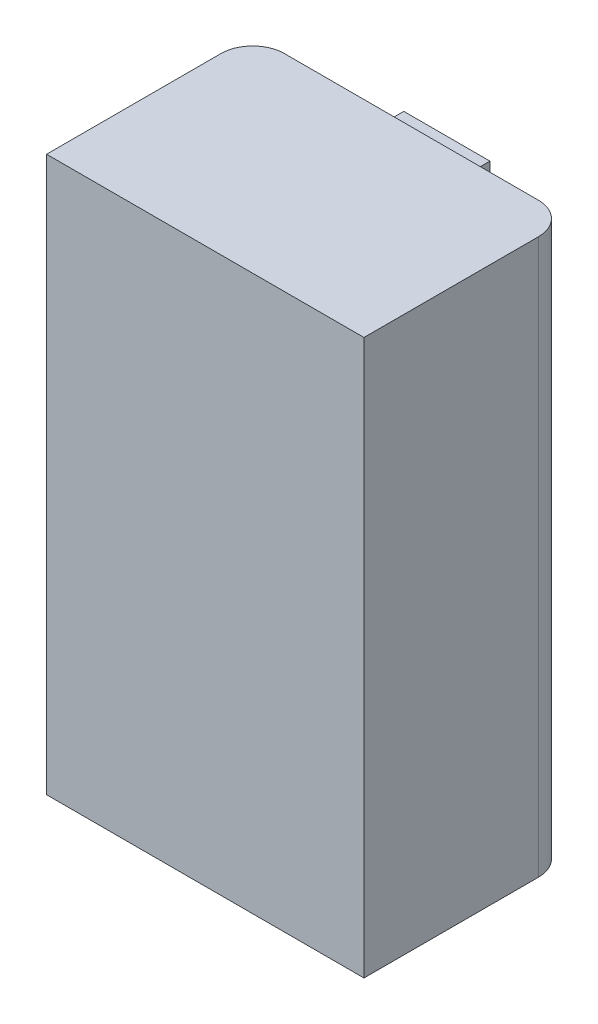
from build123d import *

# Parameters (mm, degrees)
SKETCH2_W           = 20.02592565
SKETCH2_H           = 13.003847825
BOSS_EXTRUDE1_DEPTH = 35
SKETCH4_W           = 14.816702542
SKETCH4_H           = 6.532804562
CUT_EXTRUDE1_DEPTH  = 6
FILLET1_R           = 2
BOSS_EXTRUDE2_DEPTH = 1.5


with BuildPart() as part:
    # Sketch2 → Boss-Extrude1 (new body)
    with BuildSketch(Plane(origin=(0, 0, 0), x_dir=(1, 0, 0), z_dir=(0, 1, 0))):
        with Locations((10.012962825, 6.501923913)):
            Rectangle(SKETCH2_W, SKETCH2_H)
    extrude(amount=BOSS_EXTRUDE1_DEPTH)

    # Sketch4 → Cut-Extrude1 (cut)
    with BuildSketch(Plane(origin=(0, 0, 0), x_dir=(-1, 0, 0), z_dir=(0, -1, 0))):
        with Locations((-10.016920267, 6.566876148)):
            Rectangle(SKETCH4_W, SKETCH4_H)
    extrude(amount=-CUT_EXTRUDE1_DEPTH, mode=Mode.SUBTRACT)

    # Fillet1
    fillet1_edges = [part.edges().sort_by_distance(p)[0] for p in [
        (0, 17.5, -13.003847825),
        (20.02592565, 17.5, -13.003847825),
    ]]
    fillet(fillet1_edges, radius=FILLET1_R)

    # Sketch5 → Boss-Extrude2 (add)
    # profile 1 of 4: a face of its own
    with BuildSketch(Plane(origin=(0, 0, -13.003847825), x_dir=(-1, 0, 0), z_dir=(0, 0, -1))):
        with BuildLine():
            Line((-13.469742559, 34.10669146), (-8.035448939, 34.10669146))
            Line((-8.035448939, 34.10669146), (-8.035448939, 30.88938492))
            add(Edge.make_bspline(
                [(-8.035448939, 30.88938492), (-8.037855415, 30.742353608), (-8.042555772, 30.455170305), (-8.080628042, 30.035594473), (-8.140862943, 29.63808396), (-8.228660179, 29.262985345), (-8.339571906, 28.909300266), (-8.476839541, 28.577912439), (-8.639649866, 28.2691009), (-8.794296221, 28.028995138), (-8.930487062, 27.852214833), (-9.032700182, 27.726830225), (-9.138296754, 27.610322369), (-9.248109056, 27.503497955), (-9.359377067, 27.40424544), (-9.473886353, 27.314545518), (-9.590354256, 27.232987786), (-9.70906201, 27.15900969), (-9.831782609, 27.095028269), (-9.957086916, 27.039677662), (-10.084449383, 26.990949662), (-10.214978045, 26.953233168), (-10.347653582, 26.922374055), (-10.483404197, 26.901888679), (-10.621671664, 26.888651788), (-10.714956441, 26.886741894), (-10.761901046, 26.885780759)],
                knots=[0, 0, 0, 0, 1.969308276, 3.846476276, 5.638853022, 7.350989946, 9.001834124, 10.599151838, 12.148782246, 13.672952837, 14.417780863, 15.137334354, 15.839584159, 16.522732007, 17.188703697, 17.836024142, 18.470017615, 19.092698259, 19.708342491, 20.322187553, 20.927045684, 21.533485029, 22.140791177, 22.750491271, 23.371197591, 24, 24, 24, 24], degree=3))
            add(Edge.make_bspline(
                [(-10.761901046, 26.885780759), (-10.808842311, 26.886764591), (-10.902120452, 26.888719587), (-11.040879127, 26.90166478), (-11.176967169, 26.923516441), (-11.31006788, 26.95543547), (-11.440244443, 26.994876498), (-11.568142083, 27.042444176), (-11.692127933, 27.100909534), (-11.81362104, 27.168070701), (-11.933616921, 27.241347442), (-12.048711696, 27.326853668), (-12.163629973, 27.417813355), (-12.272939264, 27.520738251), (-12.381304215, 27.630896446), (-12.486389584, 27.750203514), (-12.588808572, 27.878333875), (-12.687898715, 28.014870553), (-12.783033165, 28.159171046), (-12.871252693, 28.312157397), (-12.954092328, 28.471971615), (-13.031254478, 28.63939648), (-13.09976973, 28.815252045), (-13.166292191, 28.997256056), (-13.223850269, 29.187683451), (-13.274371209, 29.385907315), (-13.321609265, 29.59041391), (-13.360854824, 29.803174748), (-13.394172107, 30.023168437), (-13.42260064, 30.25076922), (-13.442999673, 30.485926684), (-13.458040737, 30.728714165), (-13.46754809, 30.978873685), (-13.469004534, 31.147986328), (-13.469742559, 31.23368092)],
                knots=[0, 0, 0, 0, 0.791994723, 1.573792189, 2.34921381, 3.115614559, 3.881316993, 4.643153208, 5.415782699, 6.191618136, 6.984908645, 7.785716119, 8.609182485, 9.456318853, 10.316763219, 11.215879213, 12.137419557, 13.083478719, 14.061456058, 15.052215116, 16.061652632, 17.097909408, 18.160852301, 19.245140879, 20.36675602, 21.515514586, 22.696239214, 23.907451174, 25.164795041, 26.450078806, 27.776766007, 29.146652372, 30.55412074, 32, 32, 32, 32], degree=3))
            Line((-13.469742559, 31.23368092), (-13.469742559, 34.10669146))
        make_face()
        with BuildLine():
            Line((-12.50199164, 32.320074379), (-12.50199164, 31.172033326))
            add(Edge.make_bspline(
                [(-12.50199164, 31.172033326), (-12.500715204, 31.088238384), (-12.498211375, 30.923868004), (-12.476679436, 30.68264226), (-12.442525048, 30.451238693), (-12.391981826, 30.230337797), (-12.329594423, 30.019010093), (-12.252766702, 29.817651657), (-12.160333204, 29.627187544), (-12.057005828, 29.446964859), (-11.939484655, 29.282411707), (-11.805538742, 29.139213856), (-11.658748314, 29.017017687), (-11.496959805, 28.91847568), (-11.322647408, 28.84103501), (-11.134368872, 28.786930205), (-10.933039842, 28.751734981), (-10.793849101, 28.748501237), (-10.722353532, 28.746840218)],
                knots=[0, 0, 0, 0, 1.1894114, 2.333124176, 3.435436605, 4.507723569, 5.547416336, 6.561483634, 7.563483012, 8.550063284, 9.507973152, 10.427061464, 11.326354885, 12.210922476, 13.107938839, 14.025856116, 14.985977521, 16, 16, 16, 16], degree=3))
            add(Edge.make_bspline(
                [(-10.722353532, 28.746840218), (-10.663674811, 28.74845717), (-10.547897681, 28.751647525), (-10.378189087, 28.782151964), (-10.214713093, 28.829554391), (-10.058789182, 28.898097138), (-9.907930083, 28.983044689), (-9.766063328, 29.090230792), (-9.630731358, 29.215849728), (-9.501995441, 29.357909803), (-9.385118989, 29.516886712), (-9.282118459, 29.689604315), (-9.196211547, 29.87585396), (-9.125060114, 30.073887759), (-9.070584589, 30.285009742), (-9.031297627, 30.508205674), (-9.007903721, 30.744267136), (-9.004793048, 30.905615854), (-9.003199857, 30.988253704)],
                knots=[0, 0, 0, 0, 0.893475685, 1.762888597, 2.619191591, 3.481953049, 4.352630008, 5.251948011, 6.184429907, 7.163397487, 8.169104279, 9.186511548, 10.222772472, 11.289972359, 12.389210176, 13.541344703, 14.740752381, 16, 16, 16, 16], degree=3))
            Line((-9.003199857, 30.988253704), (-9.003199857, 32.320074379))
            Line((-9.003199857, 32.320074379), (-12.50199164, 32.320074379))
        make_face(mode=Mode.SUBTRACT)
    # profile 2 of 4: a face of its own
    with BuildSketch(Plane(origin=(0, 0, -13.003847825), x_dir=(-1, 0, 0), z_dir=(0, 0, -1))):
        with BuildLine():
            Line((-8.035448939, 19.289637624), (-11.501672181, 19.289637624))
            add(Edge.make_bspline(
                [(-11.501672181, 19.289637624), (-11.557905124, 19.290706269), (-11.667002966, 19.292779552), (-11.82637221, 19.303778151), (-11.975736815, 19.325215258), (-12.116780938, 19.352275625), (-12.247504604, 19.38991206), (-12.36993903, 19.433380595), (-12.481437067, 19.487659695), (-12.586636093, 19.5484457), (-12.683995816, 19.622959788), (-12.776930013, 19.711668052), (-12.866145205, 19.815532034), (-12.952222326, 19.934753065), (-13.034742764, 20.069598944), (-13.114736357, 20.218957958), (-13.190016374, 20.384513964), (-13.263408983, 20.563224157), (-13.328876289, 20.75562118), (-13.387268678, 20.958110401), (-13.436173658, 21.170506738), (-13.474922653, 21.392332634), (-13.506936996, 21.623876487), (-13.528460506, 21.864927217), (-13.541355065, 22.115979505), (-13.543229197, 22.286315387), (-13.544184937, 22.373180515)],
                knots=[0, 0, 0, 0, 0.962463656, 1.867281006, 2.731508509, 3.543495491, 4.322752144, 5.057429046, 5.763753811, 6.441969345, 7.133364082, 7.856139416, 8.63700456, 9.473139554, 10.369892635, 11.340577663, 12.370759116, 13.480914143, 14.645473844, 15.846712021, 17.086048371, 18.373285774, 19.699205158, 21.085063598, 22.513488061, 24, 24, 24, 24], degree=3))
            add(Edge.make_bspline(
                [(-13.544184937, 22.373180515), (-13.543644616, 22.458493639), (-13.542585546, 22.625714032), (-13.530515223, 22.870486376), (-13.512010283, 23.104014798), (-13.487047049, 23.326091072), (-13.453178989, 23.536756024), (-13.412431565, 23.736223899), (-13.365577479, 23.924467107), (-13.309628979, 24.100717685), (-13.2460098, 24.264721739), (-13.180010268, 24.418837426), (-13.104569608, 24.559443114), (-13.026150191, 24.689934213), (-12.939432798, 24.806920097), (-12.849323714, 24.914349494), (-12.750360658, 25.006884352), (-12.648104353, 25.091070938), (-12.536856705, 25.161995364), (-12.420117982, 25.224954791), (-12.295394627, 25.277507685), (-12.164347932, 25.320586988), (-12.025605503, 25.352653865), (-11.880834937, 25.377441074), (-11.728373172, 25.391323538), (-11.624606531, 25.393035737), (-11.571461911, 25.393912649)],
                knots=[0, 0, 0, 0, 1.500050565, 2.940216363, 4.308128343, 5.618933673, 6.868690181, 8.058700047, 9.198003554, 10.278250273, 11.307644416, 12.290634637, 13.22387362, 14.11136395, 14.965003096, 15.782141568, 16.573003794, 17.343895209, 18.107881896, 18.888718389, 19.673829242, 20.484485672, 21.311322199, 22.175487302, 23.065566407, 24, 24, 24, 24], degree=3))
            Line((-11.571461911, 25.393912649), (-8.035448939, 25.393912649))
            Line((-8.035448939, 25.393912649), (-8.035448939, 23.607295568))
            Line((-8.035448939, 23.607295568), (-11.513303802, 23.607295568))
            add(Edge.make_bspline(
                [(-11.513303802, 23.607295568), (-11.566851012, 23.60581865), (-11.669635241, 23.602983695), (-11.816510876, 23.585437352), (-11.948372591, 23.552496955), (-12.066165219, 23.507979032), (-12.168281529, 23.44795012), (-12.256452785, 23.375936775), (-12.329848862, 23.290470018), (-12.4031198, 23.156035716), (-12.472748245, 22.970682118), (-12.532600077, 22.730908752), (-12.570979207, 22.471337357), (-12.574577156, 22.291512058), (-12.576434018, 22.198706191)],
                knots=[0, 0, 0, 0, 0.945593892, 1.815073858, 2.605384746, 3.340170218, 4.030530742, 4.68703654, 5.342685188, 6.004983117, 7.379206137, 8.827011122, 10.362455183, 12, 12, 12, 12], degree=3))
            add(Edge.make_bspline(
                [(-12.576434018, 22.198706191), (-12.575775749, 22.142472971), (-12.574489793, 22.032619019), (-12.564184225, 21.872639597), (-12.546182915, 21.721788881), (-12.524377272, 21.579992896), (-12.491751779, 21.447967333), (-12.455876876, 21.324052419), (-12.409614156, 21.210286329), (-12.359436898, 21.104172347), (-12.298263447, 21.009034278), (-12.222814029, 20.927004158), (-12.135727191, 20.856850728), (-12.034625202, 20.800955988), (-11.922316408, 20.755908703), (-11.796616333, 20.727595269), (-11.659428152, 20.706122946), (-11.563418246, 20.70475621), (-11.513303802, 20.704042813)],
                knots=[0, 0, 0, 0, 1.27923955, 2.499048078, 3.644553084, 4.735012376, 5.759780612, 6.736424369, 7.666762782, 8.550394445, 9.404203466, 10.228337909, 11.075514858, 11.936537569, 12.847225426, 13.818477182, 14.861307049, 16, 16, 16, 16], degree=3))
            Line((-11.513303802, 20.704042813), (-8.035448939, 20.704042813))
            Line((-8.035448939, 20.704042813), (-8.035448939, 19.289637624))
        make_face()
    # profile 3 of 4: a face of its own
    with BuildSketch(Plane(origin=(0, 0, -13.003847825), x_dir=(-1, 0, 0), z_dir=(0, 0, -1))):
        Polygon((-13.469742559, 13.777881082), (-13.469742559, 15.638940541), (-11.193434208, 15.638940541), (-8.035448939, 18.542193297), (-8.035448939, 16.522943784), (-10.173340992, 14.552547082), (-8.035448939, 12.733361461), (-8.035448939, 11.097955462), (-11.170170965, 13.777881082), align=None)
    # profile 4 of 4: a face of its own
    with BuildSketch(Plane(origin=(0, 0, -13.003847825), x_dir=(-1, 0, 0), z_dir=(0, 0, -1))):
        with BuildLine():
            Line((-13.469742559, 0.074442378), (-13.469742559, 6.848698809))
            Line((-13.469742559, 6.848698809), (-12.50199164, 6.848698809))
            Line((-12.50199164, 6.848698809), (-12.50199164, 4.243215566))
            Line((-12.50199164, 4.243215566), (-9.395185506, 4.243215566))
            add(Edge.make_bspline(
                [(-9.395185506, 4.243215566), (-9.45013022, 4.33900114), (-9.559439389, 4.529560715), (-9.710518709, 4.819934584), (-9.847690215, 5.112919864), (-9.974027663, 5.406831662), (-10.085642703, 5.703938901), (-10.183862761, 6.003026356), (-10.272813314, 6.303115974), (-10.319746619, 6.505691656), (-10.343162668, 6.606761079)],
                knots=[0, 0, 0, 0, 1.036356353, 2.061767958, 3.071071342, 4.072127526, 5.063666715, 6.048727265, 7.026467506, 8, 8, 8, 8], degree=3))
            Line((-10.343162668, 6.606761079), (-9.2416481, 6.606761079))
            add(Edge.make_bspline(
                [(-9.2416481, 6.606761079), (-9.220863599, 6.516773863), (-9.181328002, 6.345603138), (-9.122741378, 6.10269453), (-9.07100632, 5.886488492), (-9.023411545, 5.698016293), (-8.980318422, 5.536719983), (-8.942100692, 5.402613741), (-8.91020564, 5.295243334), (-8.880662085, 5.209683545), (-8.848400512, 5.134842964), (-8.814940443, 5.056626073), (-8.775523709, 4.970261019), (-8.728082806, 4.877052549), (-8.679282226, 4.773890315), (-8.621040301, 4.664592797), (-8.558913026, 4.546571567), (-8.492493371, 4.423136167), (-8.425429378, 4.299831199), (-8.354353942, 4.18508858), (-8.288039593, 4.077161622), (-8.219598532, 3.98020219), (-8.155794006, 3.889726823), (-8.089610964, 3.81084196), (-8.026497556, 3.739300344), (-7.982231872, 3.697026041), (-7.96100656, 3.676755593)],
                knots=[0, 0, 0, 0, 2.051764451, 3.9027989, 5.551143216, 6.990536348, 8.221191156, 9.26000971, 10.088346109, 10.709478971, 11.269360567, 11.898209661, 12.599673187, 13.377807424, 14.221453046, 15.134531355, 16.128642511, 17.184568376, 18.248753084, 19.245882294, 20.182664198, 21.06192294, 21.882022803, 22.640798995, 23.348265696, 24, 24, 24, 24], degree=3))
            Line((-7.96100656, 3.676755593), (-7.96100656, 2.456598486))
            Line((-7.96100656, 2.456598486), (-12.50199164, 2.456598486))
            Line((-12.50199164, 2.456598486), (-12.50199164, 0.074442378))
            Line((-12.50199164, 0.074442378), (-13.469742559, 0.074442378))
        make_face()
    extrude(amount=BOSS_EXTRUDE2_DEPTH)


solid = part.part
